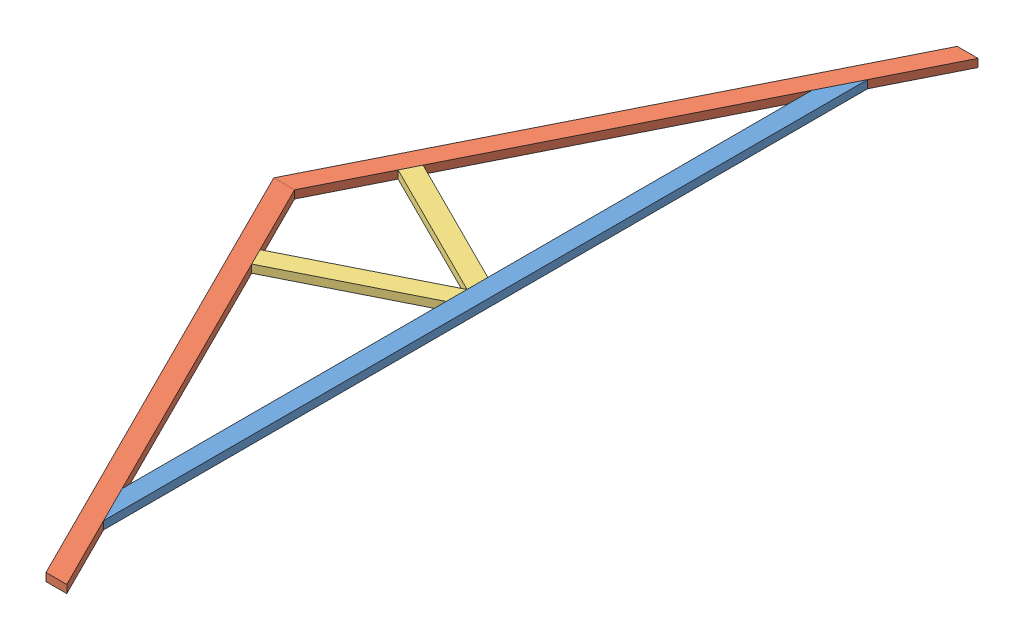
SolidWorks assembly DESN220-51C-MKrueger-Roof Truss.SLDASM, configuration Default (file format 6000). Lengths in mm.
Overall size (1190.07 38.1 4441.28).
5 component instances, 3 part files, 17 mates.
Components (placement in the parent):
- DESN220-51C-MKrueger-2x4x144 63.43º-2: DESN220-51C-MKrueger-2x4x144 63.43º.SLDPRT [Default] at origin size (88.9 38.1 3657.6)
- DESN220-51C-MKrueger-2x4x96 26.57º-1: DESN220-51C-MKrueger-2x4x96 26.57º.SLDPRT [Default] at (-1013.995 38.1 1828.8) x (-0.894389 0 0.447291) z (0.447291 0 0.894389) size (88.9 38.1 2482.86)
- DESN220-51C-MKrueger-2x4x96 26.57º-2: DESN220-51C-MKrueger-2x4x96 26.57º.SLDPRT [Default] at (176.0765 0 -352.0771) x (0.894389 0 0.447291) z (-0.447291 0 0.894389) size (88.9 38.1 2482.86)
- DESN220-51C-MKrueger-2x4x29.07 26.57º-1: DESN220-51C-MKrueger-2x4x29.07 26.57º.SLDPRT [Default] at (-749.2968 0 2159.3299) x (-0.447291 0 -0.894389) z (0.894389 0 -0.447291) size (88.9 38.1 738.38)
- DESN220-51C-MKrueger-2x4x29.07 26.57º-2: DESN220-51C-MKrueger-2x4x29.07 26.57º.SLDPRT [Default] at (-749.2968 38.1 1498.2701) x (-0.447291 0 0.894389) z (0.894389 0 0.447291) size (88.9 38.1 738.38)
Mates (geometry in assembly coordinates):
- Coincident1: coincident: point of DESN220-51C-MKrueger-2x4x144 63.43º-2; point of assembly
- Coincident2: coincident anti-aligned: plane of DESN220-51C-MKrueger-2x4x144 63.43º-2 through (-88.9 38.1 177.7616) normal (-0.894389 0 -0.447291); plane of DESN220-51C-MKrueger-2x4x96 26.57º-2 through (176.0765 38.1 -352.0771) normal (0.894389 0 0.447291)
- Coincident5: coincident anti-aligned: line of DESN220-51C-MKrueger-2x4x96 26.57º-1 through (-1013.995 0 1828.8) axis (0 1 0); line of DESN220-51C-MKrueger-2x4x96 26.57º-2 through (-1013.995 38.1 1828.8) axis (0 -1 0)
- Coincident6: coincident anti-aligned: plane of DESN220-51C-MKrueger-2x4x96 26.57º-1 through (-914.5975 0 1828.8) normal (0 0 -1); plane of DESN220-51C-MKrueger-2x4x96 26.57º-2 through (-914.5975 38.1 1828.8) normal (0 0 1)
- Coincident7: coincident anti-aligned: plane of DESN220-51C-MKrueger-2x4x144 63.43º-2 through (0 38.1 3657.6) normal (-0.894389 0 0.447291); plane of DESN220-51C-MKrueger-2x4x96 26.57º-1 through (176.0765 0 4009.6771) normal (0.894389 0 -0.447291)
- Coincident8: coincident aligned: plane of DESN220-51C-MKrueger-2x4x96 26.57º-1 through (-1013.995 0 1828.8) normal (0 -1 0); plane of DESN220-51C-MKrueger-2x4x96 26.57º-2 through (176.0765 0 -352.0771) normal (0 -1 0)
- Coincident9: coincident aligned: plane of DESN220-51C-MKrueger-2x4x144 63.43º-2 through (0 0 0) normal (0 -1 0); plane of DESN220-51C-MKrueger-2x4x96 26.57º-1 through (-1013.995 0 1828.8) normal (0 -1 0)
- Coincident10: coincident aligned: plane of DESN220-51C-MKrueger-2x4x144 63.43º-2 through (0 0 0) normal (0 -1 0); plane of DESN220-51C-MKrueger-2x4x96 26.57º-2 through (176.0765 0 -352.0771) normal (0 -1 0)
- Parallel1: parallel anti-aligned: line of DESN220-51C-MKrueger-2x4x144 63.43º-2 through (0 38.1 3657.6) axis (0 0 -1); line of assembly
- Coincident12: coincident aligned: plane of DESN220-51C-MKrueger-2x4x144 63.43º-2 through (0 38.1 0) normal (0 1 0); plane of DESN220-51C-MKrueger-2x4x29.07 26.57º-2 through (-749.2968 38.1 1498.2701) normal (0 1 0)
- Coincident13: coincident aligned: plane of DESN220-51C-MKrueger-2x4x96 26.57º-2 through (176.0765 38.1 -352.0771) normal (0 1 0); plane of DESN220-51C-MKrueger-2x4x29.07 26.57º-2 through (-749.2968 38.1 1498.2701) normal (0 1 0)
- Coincident14: coincident aligned: plane of DESN220-51C-MKrueger-2x4x96 26.57º-1 through (-1013.995 38.1 1828.8) normal (0 1 0); plane of DESN220-51C-MKrueger-2x4x29.07 26.57º-1 through (-749.2968 38.1 2159.3299) normal (0 1 0)
- Coincident15: coincident aligned: plane of DESN220-51C-MKrueger-2x4x144 63.43º-2 through (0 38.1 0) normal (0 1 0); plane of DESN220-51C-MKrueger-2x4x29.07 26.57º-1 through (-749.2968 38.1 2159.3299) normal (0 1 0)
- Coincident16: coincident anti-aligned: plane of DESN220-51C-MKrueger-2x4x144 63.43º-2 through (-88.9 38.1 3479.8384) normal (-1 0 0); plane of DESN220-51C-MKrueger-2x4x29.07 26.57º-1 through (-88.9 38.1 1829.0601) normal (1 0 0)
- Coincident17: coincident anti-aligned: plane of DESN220-51C-MKrueger-2x4x144 63.43º-2 through (-88.9 38.1 3479.8384) normal (-1 0 0); plane of DESN220-51C-MKrueger-2x4x29.07 26.57º-2 through (-88.9 0 1828.5399) normal (1 0 0)
- Coincident18: coincident aligned: line of DESN220-51C-MKrueger-2x4x96 26.57º-2 through (-914.5975 38.1 1828.8) axis (0.447291 0 -0.894389); line of DESN220-51C-MKrueger-2x4x29.07 26.57º-2 through (-749.2968 38.1 1498.2701) axis (0.447291 0 -0.894389)
- Coincident19: coincident anti-aligned: plane of DESN220-51C-MKrueger-2x4x96 26.57º-1 through (176.0765 0 4009.6771) normal (0.894389 0 -0.447291); plane of DESN220-51C-MKrueger-2x4x29.07 26.57º-1 through (-709.5327 38.1 2238.841) normal (-0.894389 0 0.447291)
